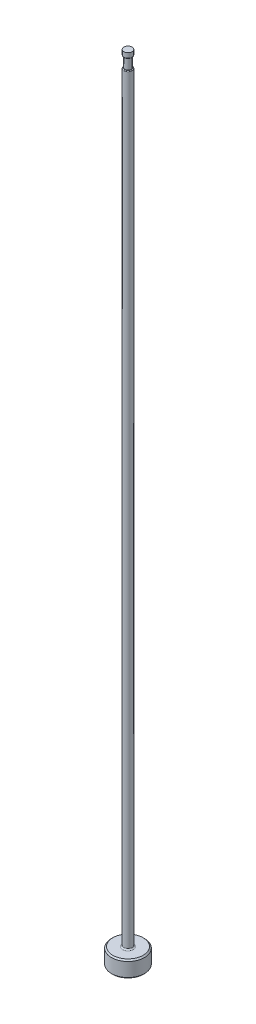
from build123d import *

# Parameters (mm, degrees)
CHAMFER1_SIZE     = 0.254
FILLET1_R         = 0.254
SKETCH2_W         = 0.2032
SKETCH2_H         = 2.032
D_SLOT_DEPTH      = 153.466131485
D_SLOT_DEPTH_BACK = 153.466131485
SKETCH5_W         = 0.00508
SKETCH5_H         = 1.016
FILLET2_R         = 0.127


with BuildPart() as part:
    # Sketch1 → Revolve1 (revolve)
    with BuildSketch(Plane.XY, mode=Mode.PRIVATE) as revolve1_sk:
        Polygon((0, 0), (-3.175, 0), (-3.175, 3.175), (-0.79375, 3.175), (-0.79375, 152.4), (0, 152.4), align=None)
    revolve(revolve1_sk.sketch.rotate(Axis((0, 259.958771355, 0), (0, -1, 0)), 270), axis=Axis((0, 259.958771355, 0), (0, -1, 0)))

    # Chamfer1
    chamfer1_edges = [part.edges().sort_by_distance(p)[0] for p in [
        (0, 3.175, -3.175),
        (0, 0, -3.175),
    ]]
    chamfer(chamfer1_edges, length=CHAMFER1_SIZE)

    # Fillet1
    fillet1_edges = [part.edges().sort_by_distance(p)[0] for p in [
        (0, 3.175, -0.79375),
    ]]
    fillet(fillet1_edges, radius=FILLET1_R)

    # Sketch2 → Vent Relief (revolve, cut)
    with BuildSketch(Plane.XY, mode=Mode.PRIVATE) as vent_relief_sk:
        with Locations((-0.69215, 150.368)):
            Rectangle(SKETCH2_W, SKETCH2_H)
    revolve(vent_relief_sk.sketch.rotate(Axis((0, 153.448281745, 0), (0, -1, 0)), 270), axis=Axis((0, 153.448281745, 0), (0, -1, 0)), mode=Mode.SUBTRACT)

    # Sketch3 → D-Slot (cut, two sides: drawn at the far end of the back side and taken through both)
    with BuildSketch(Plane.XY.offset(-D_SLOT_DEPTH_BACK)):
        with BuildLine():
            Line((-0.59055, 150.368), (-0.59055, 86.868))
            ThreePointArc((-0.59055, 86.868), (-0.641763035, 86.300038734), (-0.79375, 85.7504))
            Line((-0.79375, 85.7504), (-0.79375, 150.368))
            Line((-0.79375, 150.368), (-0.59055, 150.368))
        make_face()
    extrude(amount=D_SLOT_DEPTH + D_SLOT_DEPTH_BACK, mode=Mode.SUBTRACT)

    # Sketch5 → Vent Diameter (revolve, cut)
    with BuildSketch(Plane.XY, mode=Mode.PRIVATE) as vent_diameter_sk:
        with Locations((-0.79121, 151.892)):
            Rectangle(SKETCH5_W, SKETCH5_H)
    revolve(vent_diameter_sk.sketch.rotate(Axis((0, 152.687735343, 0), (0, -1, 0)), 90), axis=Axis((0, 152.687735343, 0), (0, -1, 0)), mode=Mode.SUBTRACT)

    # Fillet2
    fillet2_edges = [part.edges().sort_by_distance(p)[0] for p in [
        (0.724920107, 149.352, -0.323310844),
        (0, 151.384, 0.78867),
    ]]
    fillet(fillet2_edges, radius=FILLET2_R)


solid = part.part
